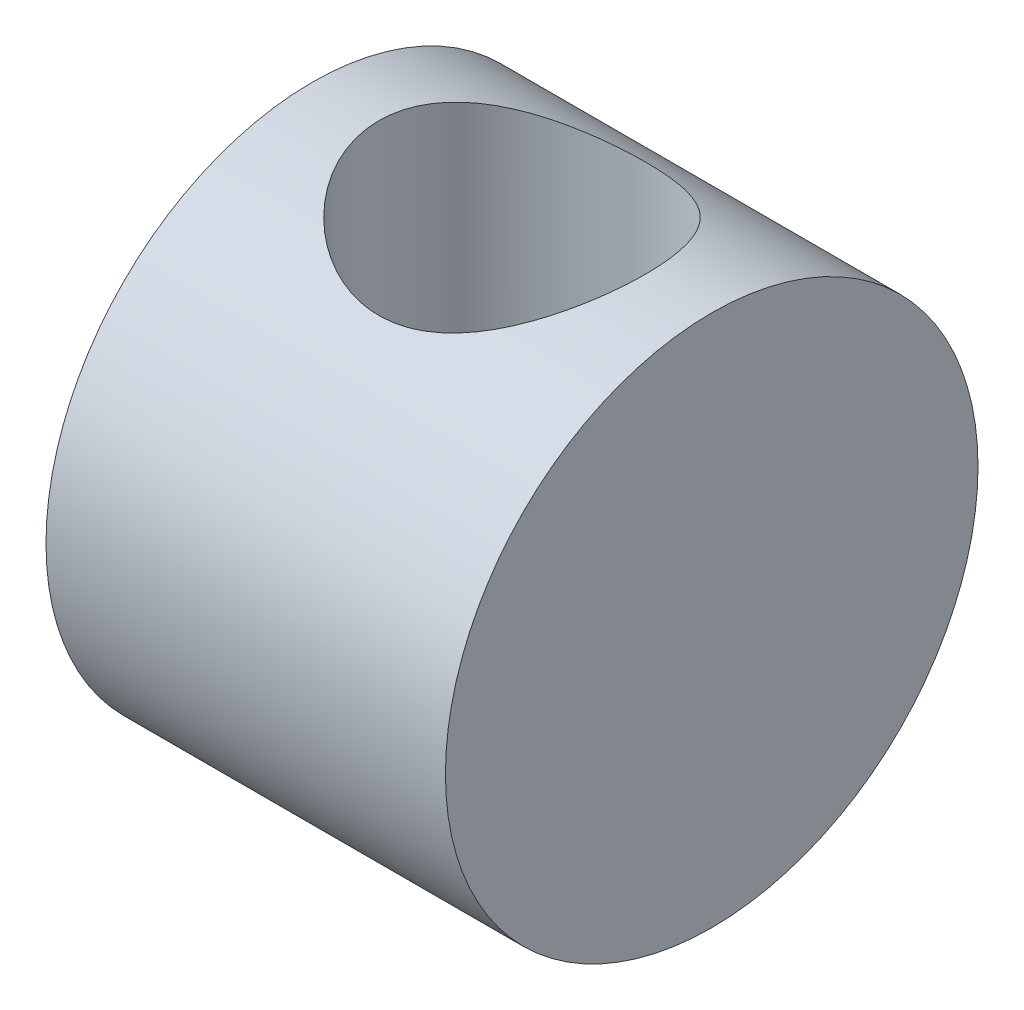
from build123d import *

# Parameters (mm, degrees)
SKETCH1_R               = 50
BOSS_EXTRUDE1_DEPTH     = 75
CUT_EXTRUDE1_DEPTH      = 100
CUT_EXTRUDE1_DEPTH_BACK = 100
SKETCH2_R               = 25


with BuildPart() as part:
    # Sketch1 → Boss-Extrude1 (new body)
    with BuildSketch(Plane(origin=(0, 0, 0), x_dir=(0, 0, -1), z_dir=(1, 0, 0))):
        Circle(SKETCH1_R)
    extrude(amount=BOSS_EXTRUDE1_DEPTH)

    # Sketch2 → Cut-Extrude1 (cut, two sides: drawn at the far end of the back side and taken through both)
    with BuildSketch(Plane(origin=(0, 0, 0), x_dir=(1, 0, 0), z_dir=(0, 1, 0)).offset(-CUT_EXTRUDE1_DEPTH_BACK)):
        with Locations(Location((37.5, 0, 0), (0, 0, 90))):
            Circle(SKETCH2_R)
    extrude(amount=CUT_EXTRUDE1_DEPTH + CUT_EXTRUDE1_DEPTH_BACK, mode=Mode.SUBTRACT)


solid = part.part
